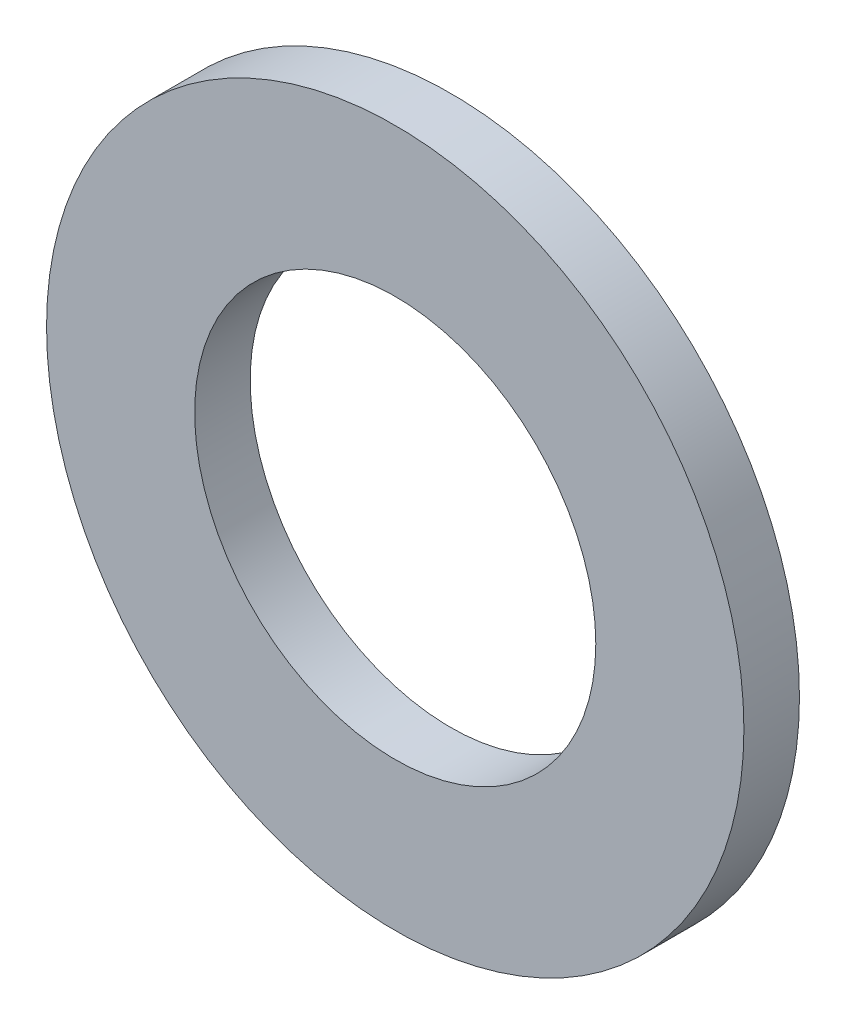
ISO-10303-21;
HEADER;
FILE_DESCRIPTION(('STEP AP214'),'2;1');
FILE_NAME('part.step','',(''),(''),'','','');
FILE_SCHEMA(('AUTOMOTIVE_DESIGN { 1 0 10303 214 1 1 1 1 }'));
ENDSEC;
DATA;
#1=APPLICATION_CONTEXT('core data for automotive mechanical design processes');
#2=APPLICATION_PROTOCOL_DEFINITION('international standard','automotive_design',2000,#1);
#3=PRODUCT_CONTEXT('',#1,'mechanical');
#4=PRODUCT('Part','Part','',(#3));
#5=PRODUCT_RELATED_PRODUCT_CATEGORY('part','',(#4));
#6=PRODUCT_DEFINITION_FORMATION('','',#4);
#7=PRODUCT_DEFINITION_CONTEXT('part definition',#1,'design');
#8=PRODUCT_DEFINITION('design','',#6,#7);
#9=PRODUCT_DEFINITION_SHAPE('','',#8);
#10=(LENGTH_UNIT() NAMED_UNIT(*) SI_UNIT(.MILLI.,.METRE.));
#11=(NAMED_UNIT(*) PLANE_ANGLE_UNIT() SI_UNIT($,.RADIAN.));
#12=(NAMED_UNIT(*) SI_UNIT($,.STERADIAN.) SOLID_ANGLE_UNIT());
#13=UNCERTAINTY_MEASURE_WITH_UNIT(LENGTH_MEASURE(1.E-05),#10,'distance_accuracy_value','');
#14=(GEOMETRIC_REPRESENTATION_CONTEXT(3) GLOBAL_UNCERTAINTY_ASSIGNED_CONTEXT((#13)) GLOBAL_UNIT_ASSIGNED_CONTEXT((#10,
#11,#12)) REPRESENTATION_CONTEXT('',''));
#15=CARTESIAN_POINT('',(0.,0.,0.));
#16=DIRECTION('',(0.,0.,1.));
#17=DIRECTION('',(1.,0.,0.));
#18=AXIS2_PLACEMENT_3D('',#15,#16,#17);
#19=CARTESIAN_POINT('',(0.,0.,0.9));
#20=DIRECTION('',(0.,0.,1.));
#21=DIRECTION('',(1.,0.,0.));
#22=AXIS2_PLACEMENT_3D('',#19,#20,#21);
#23=PLANE('',#22);
#24=CARTESIAN_POINT('',(0.,0.,0.9));
#25=DIRECTION('',(0.,0.,1.));
#26=DIRECTION('',(1.,0.,0.));
#27=AXIS2_PLACEMENT_3D('',#24,#25,#26);
#28=CIRCLE('',#27,5.65);
#29=CARTESIAN_POINT('',(5.65,0.,0.9));
#30=VERTEX_POINT('',#29);
#31=EDGE_CURVE('E10',#30,#30,#28,.T.);
#32=ORIENTED_EDGE('',*,*,#31,.T.);
#33=EDGE_LOOP('',(#32));
#34=FACE_BOUND('',#33,.T.);
#35=CARTESIAN_POINT('',(0.,0.,0.9));
#36=DIRECTION('',(0.,0.,1.));
#37=DIRECTION('',(1.,0.,0.));
#38=AXIS2_PLACEMENT_3D('',#35,#36,#37);
#39=CIRCLE('',#38,3.25);
#40=CARTESIAN_POINT('',(3.25,0.,0.9));
#41=VERTEX_POINT('',#40);
#42=EDGE_CURVE('E27',#41,#41,#39,.T.);
#43=ORIENTED_EDGE('',*,*,#42,.F.);
#44=EDGE_LOOP('',(#43));
#45=FACE_BOUND('',#44,.T.);
#46=ADVANCED_FACE('F16',(#34,#45),#23,.T.);
#47=CARTESIAN_POINT('',(0.,0.,0.));
#48=DIRECTION('',(0.,0.,1.));
#49=DIRECTION('',(1.,0.,0.));
#50=AXIS2_PLACEMENT_3D('',#47,#48,#49);
#51=PLANE('',#50);
#52=CARTESIAN_POINT('',(0.,0.,0.));
#53=DIRECTION('',(0.,0.,1.));
#54=DIRECTION('',(1.,0.,0.));
#55=AXIS2_PLACEMENT_3D('',#52,#53,#54);
#56=CIRCLE('',#55,5.65);
#57=CARTESIAN_POINT('',(5.65,0.,0.));
#58=VERTEX_POINT('',#57);
#59=EDGE_CURVE('E20',#58,#58,#56,.T.);
#60=ORIENTED_EDGE('',*,*,#59,.F.);
#61=EDGE_LOOP('',(#60));
#62=FACE_BOUND('',#61,.T.);
#63=CARTESIAN_POINT('',(0.,0.,0.));
#64=DIRECTION('',(0.,0.,1.));
#65=DIRECTION('',(1.,0.,0.));
#66=AXIS2_PLACEMENT_3D('',#63,#64,#65);
#67=CIRCLE('',#66,3.25);
#68=CARTESIAN_POINT('',(3.25,0.,0.));
#69=VERTEX_POINT('',#68);
#70=EDGE_CURVE('E29',#69,#69,#67,.T.);
#71=ORIENTED_EDGE('',*,*,#70,.T.);
#72=EDGE_LOOP('',(#71));
#73=FACE_BOUND('',#72,.T.);
#74=ADVANCED_FACE('F39',(#62,#73),#51,.F.);
#75=CARTESIAN_POINT('',(0.,0.,0.9));
#76=DIRECTION('',(0.,0.,-1.));
#77=DIRECTION('',(-1.,0.,0.));
#78=AXIS2_PLACEMENT_3D('',#75,#76,#77);
#79=CYLINDRICAL_SURFACE('',#78,5.65);
#80=ORIENTED_EDGE('',*,*,#31,.F.);
#81=EDGE_LOOP('',(#80));
#82=FACE_BOUND('',#81,.T.);
#83=ORIENTED_EDGE('',*,*,#59,.T.);
#84=EDGE_LOOP('',(#83));
#85=FACE_BOUND('',#84,.T.);
#86=ADVANCED_FACE('F18',(#82,#85),#79,.T.);
#87=CARTESIAN_POINT('',(0.,0.,0.9));
#88=DIRECTION('',(0.,0.,-1.));
#89=DIRECTION('',(-1.,0.,0.));
#90=AXIS2_PLACEMENT_3D('',#87,#88,#89);
#91=CYLINDRICAL_SURFACE('',#90,3.25);
#92=ORIENTED_EDGE('',*,*,#42,.T.);
#93=EDGE_LOOP('',(#92));
#94=FACE_BOUND('',#93,.T.);
#95=ORIENTED_EDGE('',*,*,#70,.F.);
#96=EDGE_LOOP('',(#95));
#97=FACE_BOUND('',#96,.T.);
#98=ADVANCED_FACE('F35',(#94,#97),#91,.F.);
#99=CLOSED_SHELL('',(#46,#74,#86,#98));
#100=MANIFOLD_SOLID_BREP('B1',#99);
#101=ADVANCED_BREP_SHAPE_REPRESENTATION('',(#18,#100),#14);
#102=SHAPE_DEFINITION_REPRESENTATION(#9,#101);
ENDSEC;
END-ISO-10303-21;
